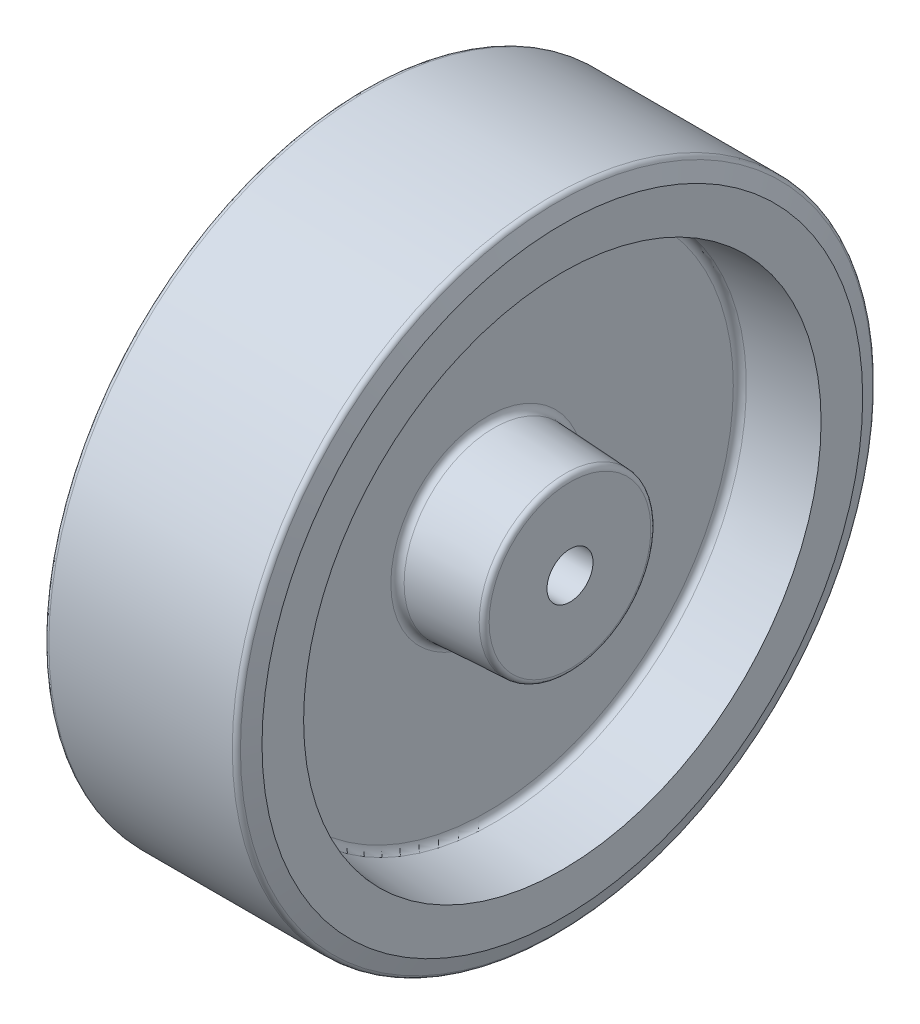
ISO-10303-21;
HEADER;
FILE_DESCRIPTION(('STEP AP214'),'2;1');
FILE_NAME('part.step','',(''),(''),'','','');
FILE_SCHEMA(('AUTOMOTIVE_DESIGN { 1 0 10303 214 1 1 1 1 }'));
ENDSEC;
DATA;
#1=APPLICATION_CONTEXT('core data for automotive mechanical design processes');
#2=APPLICATION_PROTOCOL_DEFINITION('international standard','automotive_design',2000,#1);
#3=PRODUCT_CONTEXT('',#1,'mechanical');
#4=PRODUCT('Part','Part','',(#3));
#5=PRODUCT_RELATED_PRODUCT_CATEGORY('part','',(#4));
#6=PRODUCT_DEFINITION_FORMATION('','',#4);
#7=PRODUCT_DEFINITION_CONTEXT('part definition',#1,'design');
#8=PRODUCT_DEFINITION('design','',#6,#7);
#9=PRODUCT_DEFINITION_SHAPE('','',#8);
#10=(LENGTH_UNIT() NAMED_UNIT(*) SI_UNIT(.MILLI.,.METRE.));
#11=(NAMED_UNIT(*) PLANE_ANGLE_UNIT() SI_UNIT($,.RADIAN.));
#12=(NAMED_UNIT(*) SI_UNIT($,.STERADIAN.) SOLID_ANGLE_UNIT());
#13=UNCERTAINTY_MEASURE_WITH_UNIT(LENGTH_MEASURE(1.E-05),#10,'distance_accuracy_value','');
#14=(GEOMETRIC_REPRESENTATION_CONTEXT(3) GLOBAL_UNCERTAINTY_ASSIGNED_CONTEXT((#13)) GLOBAL_UNIT_ASSIGNED_CONTEXT((#10,
#11,#12)) REPRESENTATION_CONTEXT('',''));
#15=CARTESIAN_POINT('',(0.,0.,0.));
#16=DIRECTION('',(0.,0.,1.));
#17=DIRECTION('',(1.,0.,0.));
#18=AXIS2_PLACEMENT_3D('',#15,#16,#17);
#19=CARTESIAN_POINT('',(42.9999999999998,9.00000000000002,0.));
#20=DIRECTION('',(-1.,0.,0.));
#21=DIRECTION('',(0.,0.,1.));
#22=AXIS2_PLACEMENT_3D('',#19,#20,#21);
#23=PLANE('',#22);
#24=CARTESIAN_POINT('',(42.9999999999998,0.,0.));
#25=DIRECTION('',(-1.,0.,0.));
#26=DIRECTION('',(0.,0.,1.));
#27=AXIS2_PLACEMENT_3D('',#24,#25,#26);
#28=CIRCLE('',#27,31.64);
#29=CARTESIAN_POINT('',(42.9999999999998,0.,31.64));
#30=VERTEX_POINT('',#29);
#31=EDGE_CURVE('E10',#30,#30,#28,.T.);
#32=ORIENTED_EDGE('',*,*,#31,.F.);
#33=EDGE_LOOP('',(#32));
#34=FACE_BOUND('',#33,.T.);
#35=CARTESIAN_POINT('',(42.9999999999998,0.,0.));
#36=DIRECTION('',(-1.,0.,0.));
#37=DIRECTION('',(0.,0.,1.));
#38=AXIS2_PLACEMENT_3D('',#35,#36,#37);
#39=CIRCLE('',#38,9.00000000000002);
#40=CARTESIAN_POINT('',(42.9999999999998,0.,9.00000000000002));
#41=VERTEX_POINT('',#40);
#42=EDGE_CURVE('E102',#41,#41,#39,.T.);
#43=ORIENTED_EDGE('',*,*,#42,.T.);
#44=EDGE_LOOP('',(#43));
#45=FACE_BOUND('',#44,.T.);
#46=ADVANCED_FACE('F32',(#34,#45),#23,.F.);
#47=CARTESIAN_POINT('',(40.9999999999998,0.,0.));
#48=DIRECTION('',(-1.,0.,0.));
#49=DIRECTION('',(0.,0.,1.));
#50=AXIS2_PLACEMENT_3D('',#47,#48,#49);
#51=TOROIDAL_SURFACE('',#50,31.64,2.);
#52=CARTESIAN_POINT('',(41.1046719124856,0.,0.));
#53=DIRECTION('',(-1.,0.,0.));
#54=DIRECTION('',(0.,0.,1.));
#55=AXIS2_PLACEMENT_3D('',#52,#53,#54);
#56=CIRCLE('',#55,33.6372590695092);
#57=CARTESIAN_POINT('',(41.1046719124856,0.,33.6372590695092));
#58=VERTEX_POINT('',#57);
#59=EDGE_CURVE('E38',#58,#58,#56,.T.);
#60=ORIENTED_EDGE('',*,*,#59,.F.);
#61=EDGE_LOOP('',(#60));
#62=FACE_BOUND('',#61,.T.);
#63=ORIENTED_EDGE('',*,*,#31,.T.);
#64=EDGE_LOOP('',(#63));
#65=FACE_BOUND('',#64,.T.);
#66=ADVANCED_FACE('F223',(#62,#65),#51,.T.);
#67=CARTESIAN_POINT('',(41.1046719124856,0.,0.));
#68=DIRECTION('',(-1.,0.,0.));
#69=DIRECTION('',(0.,0.,1.));
#70=AXIS2_PLACEMENT_3D('',#67,#68,#69);
#71=CONICAL_SURFACE('',#70,33.6372590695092,0.0523598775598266);
#72=CARTESIAN_POINT('',(13.2002629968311,0.,0.));
#73=DIRECTION('',(-1.,0.,0.));
#74=DIRECTION('',(0.,0.,1.));
#75=AXIS2_PLACEMENT_3D('',#72,#73,#74);
#76=CIRCLE('',#75,35.0996671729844);
#77=CARTESIAN_POINT('',(13.2002629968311,0.,35.0996671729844));
#78=VERTEX_POINT('',#77);
#79=EDGE_CURVE('E42',#78,#78,#76,.T.);
#80=ORIENTED_EDGE('',*,*,#79,.F.);
#81=EDGE_LOOP('',(#80));
#82=FACE_BOUND('',#81,.T.);
#83=ORIENTED_EDGE('',*,*,#59,.T.);
#84=EDGE_LOOP('',(#83));
#85=FACE_BOUND('',#84,.T.);
#86=ADVANCED_FACE('F218',(#82,#85),#71,.T.);
#87=CARTESIAN_POINT('',(13.3399999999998,0.,0.));
#88=DIRECTION('',(-1.,0.,0.));
#89=DIRECTION('',(0.,0.,1.));
#90=AXIS2_PLACEMENT_3D('',#87,#88,#89);
#91=TOROIDAL_SURFACE('',#90,37.7660080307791,2.67);
#92=CARTESIAN_POINT('',(10.6699999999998,0.,0.));
#93=DIRECTION('',(-1.,0.,0.));
#94=DIRECTION('',(0.,0.,1.));
#95=AXIS2_PLACEMENT_3D('',#92,#93,#94);
#96=CIRCLE('',#95,37.7660080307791);
#97=CARTESIAN_POINT('',(10.6699999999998,0.,37.7660080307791));
#98=VERTEX_POINT('',#97);
#99=EDGE_CURVE('E46',#98,#98,#96,.T.);
#100=ORIENTED_EDGE('',*,*,#99,.F.);
#101=EDGE_LOOP('',(#100));
#102=FACE_BOUND('',#101,.T.);
#103=ORIENTED_EDGE('',*,*,#79,.T.);
#104=EDGE_LOOP('',(#103));
#105=FACE_BOUND('',#104,.T.);
#106=ADVANCED_FACE('F212',(#102,#105),#91,.F.);
#107=CARTESIAN_POINT('',(10.6699999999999,37.7660080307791,0.));
#108=DIRECTION('',(-1.,0.,0.));
#109=DIRECTION('',(0.,0.,1.));
#110=AXIS2_PLACEMENT_3D('',#107,#108,#109);
#111=PLANE('',#110);
#112=CARTESIAN_POINT('',(10.67,0.,0.));
#113=DIRECTION('',(-1.,0.,0.));
#114=DIRECTION('',(0.,0.,1.));
#115=AXIS2_PLACEMENT_3D('',#112,#113,#114);
#116=CIRCLE('',#115,96.2078803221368);
#117=CARTESIAN_POINT('',(10.67,0.,96.2078803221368));
#118=VERTEX_POINT('',#117);
#119=EDGE_CURVE('E51',#118,#118,#116,.T.);
#120=ORIENTED_EDGE('',*,*,#119,.F.);
#121=EDGE_LOOP('',(#120));
#122=FACE_BOUND('',#121,.T.);
#123=ORIENTED_EDGE('',*,*,#99,.T.);
#124=EDGE_LOOP('',(#123));
#125=FACE_BOUND('',#124,.T.);
#126=ADVANCED_FACE('F206',(#122,#125),#111,.F.);
#127=CARTESIAN_POINT('',(13.34,0.,0.));
#128=DIRECTION('',(-1.,0.,0.));
#129=DIRECTION('',(0.,0.,1.));
#130=AXIS2_PLACEMENT_3D('',#127,#128,#129);
#131=TOROIDAL_SURFACE('',#130,96.2078803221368,2.67);
#132=CARTESIAN_POINT('',(13.1072941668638,0.,0.));
#133=DIRECTION('',(-1.,0.,0.));
#134=DIRECTION('',(0.,0.,1.));
#135=AXIS2_PLACEMENT_3D('',#132,#133,#134);
#136=CIRCLE('',#135,98.8677201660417);
#137=CARTESIAN_POINT('',(13.1072941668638,0.,98.8677201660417));
#138=VERTEX_POINT('',#137);
#139=EDGE_CURVE('E54',#138,#138,#136,.T.);
#140=ORIENTED_EDGE('',*,*,#139,.F.);
#141=EDGE_LOOP('',(#140));
#142=FACE_BOUND('',#141,.T.);
#143=ORIENTED_EDGE('',*,*,#119,.T.);
#144=EDGE_LOOP('',(#143));
#145=FACE_BOUND('',#144,.T.);
#146=ADVANCED_FACE('F200',(#142,#145),#131,.F.);
#147=CARTESIAN_POINT('',(13.1072941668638,0.,0.));
#148=DIRECTION('',(1.,0.,0.));
#149=DIRECTION('',(0.,0.,-1.));
#150=AXIS2_PLACEMENT_3D('',#147,#148,#149);
#151=CONICAL_SURFACE('',#150,98.8677201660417,0.0872664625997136);
#152=CARTESIAN_POINT('',(40.,0.,0.));
#153=DIRECTION('',(-1.,0.,0.));
#154=DIRECTION('',(0.,0.,1.));
#155=AXIS2_PLACEMENT_3D('',#152,#153,#154);
#156=CIRCLE('',#155,101.220527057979);
#157=CARTESIAN_POINT('',(40.,0.,101.220527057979));
#158=VERTEX_POINT('',#157);
#159=EDGE_CURVE('E57',#158,#158,#156,.T.);
#160=ORIENTED_EDGE('',*,*,#159,.F.);
#161=EDGE_LOOP('',(#160));
#162=FACE_BOUND('',#161,.T.);
#163=ORIENTED_EDGE('',*,*,#139,.T.);
#164=EDGE_LOOP('',(#163));
#165=FACE_BOUND('',#164,.T.);
#166=ADVANCED_FACE('F194',(#162,#165),#151,.F.);
#167=CARTESIAN_POINT('',(40.,101.220527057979,0.));
#168=DIRECTION('',(-1.,0.,0.));
#169=DIRECTION('',(0.,0.,1.));
#170=AXIS2_PLACEMENT_3D('',#167,#168,#169);
#171=PLANE('',#170);
#172=CARTESIAN_POINT('',(40.,0.,0.));
#173=DIRECTION('',(-1.,0.,0.));
#174=DIRECTION('',(0.,0.,1.));
#175=AXIS2_PLACEMENT_3D('',#172,#173,#174);
#176=CIRCLE('',#175,117.500527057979);
#177=CARTESIAN_POINT('',(40.,0.,117.500527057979));
#178=VERTEX_POINT('',#177);
#179=EDGE_CURVE('E60',#178,#178,#176,.T.);
#180=ORIENTED_EDGE('',*,*,#179,.F.);
#181=EDGE_LOOP('',(#180));
#182=FACE_BOUND('',#181,.T.);
#183=ORIENTED_EDGE('',*,*,#159,.T.);
#184=EDGE_LOOP('',(#183));
#185=FACE_BOUND('',#184,.T.);
#186=ADVANCED_FACE('F188',(#182,#185),#171,.F.);
#187=CARTESIAN_POINT('',(40.,0.,0.));
#188=DIRECTION('',(-1.,0.,0.));
#189=DIRECTION('',(0.,0.,1.));
#190=AXIS2_PLACEMENT_3D('',#187,#188,#189);
#191=CONICAL_SURFACE('',#190,117.500527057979,1.22173047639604);
#192=CARTESIAN_POINT('',(37.7493852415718,0.,0.));
#193=DIRECTION('',(-1.,0.,0.));
#194=DIRECTION('',(0.,0.,1.));
#195=AXIS2_PLACEMENT_3D('',#192,#193,#194);
#196=CIRCLE('',#195,123.684040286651);
#197=CARTESIAN_POINT('',(37.7493852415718,0.,123.684040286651));
#198=VERTEX_POINT('',#197);
#199=EDGE_CURVE('E63',#198,#198,#196,.T.);
#200=ORIENTED_EDGE('',*,*,#199,.F.);
#201=EDGE_LOOP('',(#200));
#202=FACE_BOUND('',#201,.T.);
#203=ORIENTED_EDGE('',*,*,#179,.T.);
#204=EDGE_LOOP('',(#203));
#205=FACE_BOUND('',#204,.T.);
#206=ADVANCED_FACE('F182',(#202,#205),#191,.T.);
#207=CARTESIAN_POINT('',(35.87,0.,0.));
#208=DIRECTION('',(-1.,0.,0.));
#209=DIRECTION('',(0.,0.,1.));
#210=AXIS2_PLACEMENT_3D('',#207,#208,#209);
#211=TOROIDAL_SURFACE('',#210,123.,2.);
#212=CARTESIAN_POINT('',(35.87,0.,0.));
#213=DIRECTION('',(-1.,0.,0.));
#214=DIRECTION('',(0.,0.,1.));
#215=AXIS2_PLACEMENT_3D('',#212,#213,#214);
#216=CIRCLE('',#215,125.);
#217=CARTESIAN_POINT('',(35.87,0.,125.));
#218=VERTEX_POINT('',#217);
#219=EDGE_CURVE('E66',#218,#218,#216,.T.);
#220=ORIENTED_EDGE('',*,*,#219,.F.);
#221=EDGE_LOOP('',(#220));
#222=FACE_BOUND('',#221,.T.);
#223=ORIENTED_EDGE('',*,*,#199,.T.);
#224=EDGE_LOOP('',(#223));
#225=FACE_BOUND('',#224,.T.);
#226=ADVANCED_FACE('F176',(#222,#225),#211,.T.);
#227=CARTESIAN_POINT('',(-469.674938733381,0.,0.));
#228=DIRECTION('',(-1.,0.,0.));
#229=DIRECTION('',(0.,0.,1.));
#230=AXIS2_PLACEMENT_3D('',#227,#228,#229);
#231=CYLINDRICAL_SURFACE('',#230,125.);
#232=CARTESIAN_POINT('',(-35.87,0.,0.));
#233=DIRECTION('',(-1.,0.,0.));
#234=DIRECTION('',(0.,0.,1.));
#235=AXIS2_PLACEMENT_3D('',#232,#233,#234);
#236=CIRCLE('',#235,125.);
#237=CARTESIAN_POINT('',(-35.87,0.,125.));
#238=VERTEX_POINT('',#237);
#239=EDGE_CURVE('E69',#238,#238,#236,.T.);
#240=ORIENTED_EDGE('',*,*,#239,.F.);
#241=EDGE_LOOP('',(#240));
#242=FACE_BOUND('',#241,.T.);
#243=ORIENTED_EDGE('',*,*,#219,.T.);
#244=EDGE_LOOP('',(#243));
#245=FACE_BOUND('',#244,.T.);
#246=ADVANCED_FACE('F170',(#242,#245),#231,.T.);
#247=CARTESIAN_POINT('',(-35.87,0.,0.));
#248=DIRECTION('',(-1.,0.,0.));
#249=DIRECTION('',(0.,0.,1.));
#250=AXIS2_PLACEMENT_3D('',#247,#248,#249);
#251=TOROIDAL_SURFACE('',#250,123.,2.);
#252=CARTESIAN_POINT('',(-37.7493852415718,0.,0.));
#253=DIRECTION('',(-1.,0.,0.));
#254=DIRECTION('',(0.,0.,1.));
#255=AXIS2_PLACEMENT_3D('',#252,#253,#254);
#256=CIRCLE('',#255,123.684040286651);
#257=CARTESIAN_POINT('',(-37.7493852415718,0.,123.684040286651));
#258=VERTEX_POINT('',#257);
#259=EDGE_CURVE('E72',#258,#258,#256,.T.);
#260=ORIENTED_EDGE('',*,*,#259,.F.);
#261=EDGE_LOOP('',(#260));
#262=FACE_BOUND('',#261,.T.);
#263=ORIENTED_EDGE('',*,*,#239,.T.);
#264=EDGE_LOOP('',(#263));
#265=FACE_BOUND('',#264,.T.);
#266=ADVANCED_FACE('F164',(#262,#265),#251,.T.);
#267=CARTESIAN_POINT('',(-37.7493852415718,0.,0.));
#268=DIRECTION('',(1.,0.,0.));
#269=DIRECTION('',(0.,0.,-1.));
#270=AXIS2_PLACEMENT_3D('',#267,#268,#269);
#271=CONICAL_SURFACE('',#270,123.684040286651,1.22173047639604);
#272=CARTESIAN_POINT('',(-40.,0.,0.));
#273=DIRECTION('',(-1.,0.,0.));
#274=DIRECTION('',(0.,0.,1.));
#275=AXIS2_PLACEMENT_3D('',#272,#273,#274);
#276=CIRCLE('',#275,117.500527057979);
#277=CARTESIAN_POINT('',(-40.,0.,117.500527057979));
#278=VERTEX_POINT('',#277);
#279=EDGE_CURVE('E75',#278,#278,#276,.T.);
#280=ORIENTED_EDGE('',*,*,#279,.F.);
#281=EDGE_LOOP('',(#280));
#282=FACE_BOUND('',#281,.T.);
#283=ORIENTED_EDGE('',*,*,#259,.T.);
#284=EDGE_LOOP('',(#283));
#285=FACE_BOUND('',#284,.T.);
#286=ADVANCED_FACE('F158',(#282,#285),#271,.T.);
#287=CARTESIAN_POINT('',(-40.,101.220527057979,0.));
#288=DIRECTION('',(1.,0.,0.));
#289=DIRECTION('',(0.,0.,-1.));
#290=AXIS2_PLACEMENT_3D('',#287,#288,#289);
#291=PLANE('',#290);
#292=CARTESIAN_POINT('',(-40.,0.,0.));
#293=DIRECTION('',(-1.,0.,0.));
#294=DIRECTION('',(0.,0.,1.));
#295=AXIS2_PLACEMENT_3D('',#292,#293,#294);
#296=CIRCLE('',#295,101.220527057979);
#297=CARTESIAN_POINT('',(-40.,0.,101.220527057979));
#298=VERTEX_POINT('',#297);
#299=EDGE_CURVE('E78',#298,#298,#296,.T.);
#300=ORIENTED_EDGE('',*,*,#299,.F.);
#301=EDGE_LOOP('',(#300));
#302=FACE_BOUND('',#301,.T.);
#303=ORIENTED_EDGE('',*,*,#279,.T.);
#304=EDGE_LOOP('',(#303));
#305=FACE_BOUND('',#304,.T.);
#306=ADVANCED_FACE('F152',(#302,#305),#291,.F.);
#307=CARTESIAN_POINT('',(-40.,0.,0.));
#308=DIRECTION('',(-1.,0.,0.));
#309=DIRECTION('',(0.,0.,1.));
#310=AXIS2_PLACEMENT_3D('',#307,#308,#309);
#311=CONICAL_SURFACE('',#310,101.220527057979,0.0872664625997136);
#312=CARTESIAN_POINT('',(-13.1072941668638,0.,0.));
#313=DIRECTION('',(-1.,0.,0.));
#314=DIRECTION('',(0.,0.,1.));
#315=AXIS2_PLACEMENT_3D('',#312,#313,#314);
#316=CIRCLE('',#315,98.8677201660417);
#317=CARTESIAN_POINT('',(-13.1072941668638,0.,98.8677201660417));
#318=VERTEX_POINT('',#317);
#319=EDGE_CURVE('E81',#318,#318,#316,.T.);
#320=ORIENTED_EDGE('',*,*,#319,.F.);
#321=EDGE_LOOP('',(#320));
#322=FACE_BOUND('',#321,.T.);
#323=ORIENTED_EDGE('',*,*,#299,.T.);
#324=EDGE_LOOP('',(#323));
#325=FACE_BOUND('',#324,.T.);
#326=ADVANCED_FACE('F146',(#322,#325),#311,.F.);
#327=CARTESIAN_POINT('',(-13.34,0.,0.));
#328=DIRECTION('',(-1.,0.,0.));
#329=DIRECTION('',(0.,0.,1.));
#330=AXIS2_PLACEMENT_3D('',#327,#328,#329);
#331=TOROIDAL_SURFACE('',#330,96.2078803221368,2.67);
#332=CARTESIAN_POINT('',(-10.67,0.,0.));
#333=DIRECTION('',(-1.,0.,0.));
#334=DIRECTION('',(0.,0.,1.));
#335=AXIS2_PLACEMENT_3D('',#332,#333,#334);
#336=CIRCLE('',#335,96.2078803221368);
#337=CARTESIAN_POINT('',(-10.67,0.,96.2078803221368));
#338=VERTEX_POINT('',#337);
#339=EDGE_CURVE('E84',#338,#338,#336,.T.);
#340=ORIENTED_EDGE('',*,*,#339,.F.);
#341=EDGE_LOOP('',(#340));
#342=FACE_BOUND('',#341,.T.);
#343=ORIENTED_EDGE('',*,*,#319,.T.);
#344=EDGE_LOOP('',(#343));
#345=FACE_BOUND('',#344,.T.);
#346=ADVANCED_FACE('F140',(#342,#345),#331,.F.);
#347=CARTESIAN_POINT('',(-10.6699999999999,37.7660080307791,0.));
#348=DIRECTION('',(1.,0.,0.));
#349=DIRECTION('',(0.,0.,-1.));
#350=AXIS2_PLACEMENT_3D('',#347,#348,#349);
#351=PLANE('',#350);
#352=CARTESIAN_POINT('',(-10.6699999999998,0.,0.));
#353=DIRECTION('',(-1.,0.,0.));
#354=DIRECTION('',(0.,0.,1.));
#355=AXIS2_PLACEMENT_3D('',#352,#353,#354);
#356=CIRCLE('',#355,37.7660080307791);
#357=CARTESIAN_POINT('',(-10.6699999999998,0.,37.7660080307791));
#358=VERTEX_POINT('',#357);
#359=EDGE_CURVE('E87',#358,#358,#356,.T.);
#360=ORIENTED_EDGE('',*,*,#359,.F.);
#361=EDGE_LOOP('',(#360));
#362=FACE_BOUND('',#361,.T.);
#363=ORIENTED_EDGE('',*,*,#339,.T.);
#364=EDGE_LOOP('',(#363));
#365=FACE_BOUND('',#364,.T.);
#366=ADVANCED_FACE('F134',(#362,#365),#351,.F.);
#367=CARTESIAN_POINT('',(-13.3399999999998,0.,0.));
#368=DIRECTION('',(-1.,0.,0.));
#369=DIRECTION('',(0.,0.,1.));
#370=AXIS2_PLACEMENT_3D('',#367,#368,#369);
#371=TOROIDAL_SURFACE('',#370,37.7660080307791,2.66999999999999);
#372=CARTESIAN_POINT('',(-13.2002629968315,0.,0.));
#373=DIRECTION('',(-1.,0.,0.));
#374=DIRECTION('',(0.,0.,1.));
#375=AXIS2_PLACEMENT_3D('',#372,#373,#374);
#376=CIRCLE('',#375,35.0996671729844);
#377=CARTESIAN_POINT('',(-13.2002629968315,0.,35.0996671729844));
#378=VERTEX_POINT('',#377);
#379=EDGE_CURVE('E90',#378,#378,#376,.T.);
#380=ORIENTED_EDGE('',*,*,#379,.F.);
#381=EDGE_LOOP('',(#380));
#382=FACE_BOUND('',#381,.T.);
#383=ORIENTED_EDGE('',*,*,#359,.T.);
#384=EDGE_LOOP('',(#383));
#385=FACE_BOUND('',#384,.T.);
#386=ADVANCED_FACE('F128',(#382,#385),#371,.F.);
#387=CARTESIAN_POINT('',(-13.2002629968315,0.,0.));
#388=DIRECTION('',(1.,0.,0.));
#389=DIRECTION('',(0.,0.,-1.));
#390=AXIS2_PLACEMENT_3D('',#387,#388,#389);
#391=CONICAL_SURFACE('',#390,35.0996671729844,0.0523598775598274);
#392=CARTESIAN_POINT('',(-41.1046719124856,0.,0.));
#393=DIRECTION('',(-1.,0.,0.));
#394=DIRECTION('',(0.,0.,1.));
#395=AXIS2_PLACEMENT_3D('',#392,#393,#394);
#396=CIRCLE('',#395,33.6372590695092);
#397=CARTESIAN_POINT('',(-41.1046719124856,0.,33.6372590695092));
#398=VERTEX_POINT('',#397);
#399=EDGE_CURVE('E93',#398,#398,#396,.T.);
#400=ORIENTED_EDGE('',*,*,#399,.F.);
#401=EDGE_LOOP('',(#400));
#402=FACE_BOUND('',#401,.T.);
#403=ORIENTED_EDGE('',*,*,#379,.T.);
#404=EDGE_LOOP('',(#403));
#405=FACE_BOUND('',#404,.T.);
#406=ADVANCED_FACE('F122',(#402,#405),#391,.T.);
#407=CARTESIAN_POINT('',(-40.9999999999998,0.,0.));
#408=DIRECTION('',(-1.,0.,0.));
#409=DIRECTION('',(0.,0.,1.));
#410=AXIS2_PLACEMENT_3D('',#407,#408,#409);
#411=TOROIDAL_SURFACE('',#410,31.64,2.);
#412=CARTESIAN_POINT('',(-42.9999999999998,0.,0.));
#413=DIRECTION('',(-1.,0.,0.));
#414=DIRECTION('',(0.,0.,1.));
#415=AXIS2_PLACEMENT_3D('',#412,#413,#414);
#416=CIRCLE('',#415,31.64);
#417=CARTESIAN_POINT('',(-42.9999999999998,0.,31.64));
#418=VERTEX_POINT('',#417);
#419=EDGE_CURVE('E96',#418,#418,#416,.T.);
#420=ORIENTED_EDGE('',*,*,#419,.F.);
#421=EDGE_LOOP('',(#420));
#422=FACE_BOUND('',#421,.T.);
#423=ORIENTED_EDGE('',*,*,#399,.T.);
#424=EDGE_LOOP('',(#423));
#425=FACE_BOUND('',#424,.T.);
#426=ADVANCED_FACE('F116',(#422,#425),#411,.T.);
#427=CARTESIAN_POINT('',(-42.9999999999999,9.00000000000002,0.));
#428=DIRECTION('',(1.,0.,0.));
#429=DIRECTION('',(0.,0.,-1.));
#430=AXIS2_PLACEMENT_3D('',#427,#428,#429);
#431=PLANE('',#430);
#432=CARTESIAN_POINT('',(-43.0000000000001,0.,0.));
#433=DIRECTION('',(-1.,0.,0.));
#434=DIRECTION('',(0.,0.,1.));
#435=AXIS2_PLACEMENT_3D('',#432,#433,#434);
#436=CIRCLE('',#435,9.00000000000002);
#437=CARTESIAN_POINT('',(-43.0000000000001,0.,9.00000000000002));
#438=VERTEX_POINT('',#437);
#439=EDGE_CURVE('E99',#438,#438,#436,.T.);
#440=ORIENTED_EDGE('',*,*,#439,.F.);
#441=EDGE_LOOP('',(#440));
#442=FACE_BOUND('',#441,.T.);
#443=ORIENTED_EDGE('',*,*,#419,.T.);
#444=EDGE_LOOP('',(#443));
#445=FACE_BOUND('',#444,.T.);
#446=ADVANCED_FACE('F110',(#442,#445),#431,.F.);
#447=CARTESIAN_POINT('',(-469.674938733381,0.,0.));
#448=DIRECTION('',(-1.,0.,0.));
#449=DIRECTION('',(0.,0.,1.));
#450=AXIS2_PLACEMENT_3D('',#447,#448,#449);
#451=CYLINDRICAL_SURFACE('',#450,9.00000000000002);
#452=ORIENTED_EDGE('',*,*,#42,.F.);
#453=EDGE_LOOP('',(#452));
#454=FACE_BOUND('',#453,.T.);
#455=ORIENTED_EDGE('',*,*,#439,.T.);
#456=EDGE_LOOP('',(#455));
#457=FACE_BOUND('',#456,.T.);
#458=ADVANCED_FACE('F107',(#454,#457),#451,.F.);
#459=CLOSED_SHELL('',(#46,#66,#86,#106,#126,#146,#166,#186,#206,#226,#246,#266,#286,#306,#326,
#346,#366,#386,#406,#426,#446,#458));
#460=MANIFOLD_SOLID_BREP('B2',#459);
#461=ADVANCED_BREP_SHAPE_REPRESENTATION('',(#18,#460),#14);
#462=SHAPE_DEFINITION_REPRESENTATION(#9,#461);
ENDSEC;
END-ISO-10303-21;
